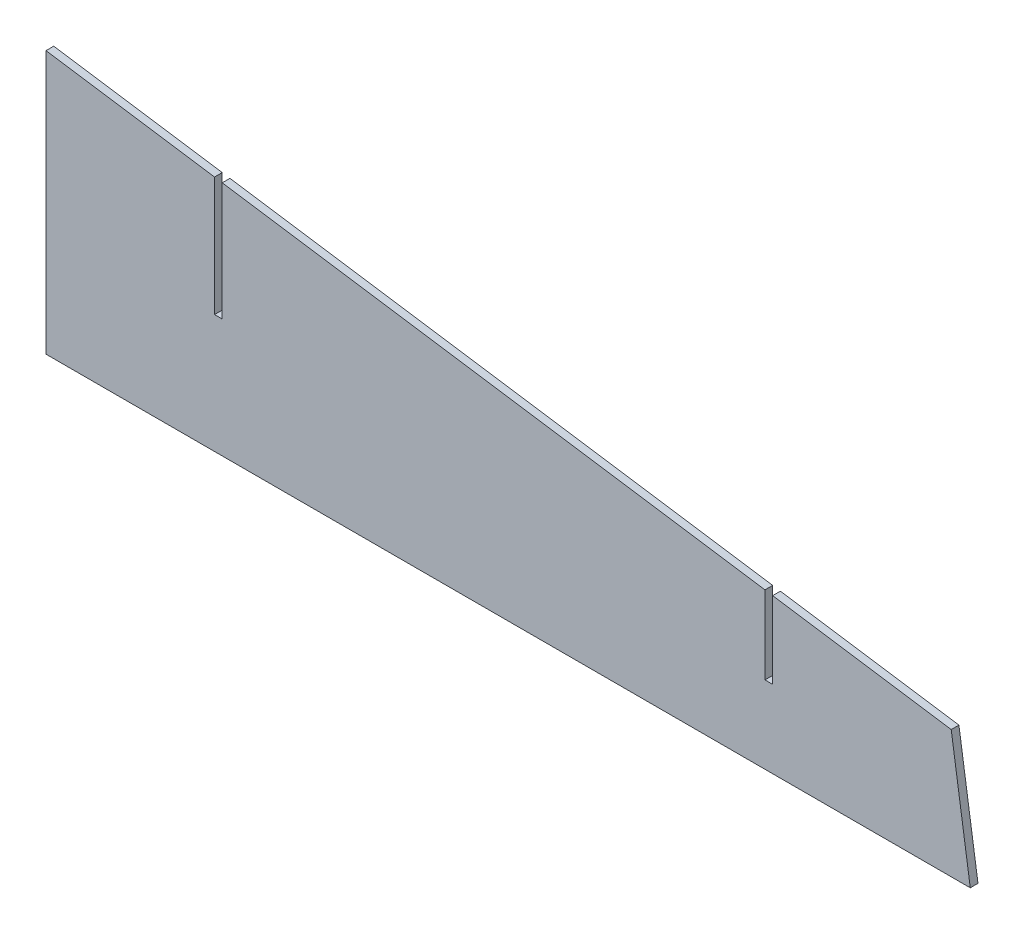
ISO-10303-21;
HEADER;
FILE_DESCRIPTION(('STEP AP214'),'2;1');
FILE_NAME('part.step','',(''),(''),'','','');
FILE_SCHEMA(('AUTOMOTIVE_DESIGN { 1 0 10303 214 1 1 1 1 }'));
ENDSEC;
DATA;
#1=APPLICATION_CONTEXT('core data for automotive mechanical design processes');
#2=APPLICATION_PROTOCOL_DEFINITION('international standard','automotive_design',2000,#1);
#3=PRODUCT_CONTEXT('',#1,'mechanical');
#4=PRODUCT('Part','Part','',(#3));
#5=PRODUCT_RELATED_PRODUCT_CATEGORY('part','',(#4));
#6=PRODUCT_DEFINITION_FORMATION('','',#4);
#7=PRODUCT_DEFINITION_CONTEXT('part definition',#1,'design');
#8=PRODUCT_DEFINITION('design','',#6,#7);
#9=PRODUCT_DEFINITION_SHAPE('','',#8);
#10=(LENGTH_UNIT() NAMED_UNIT(*) SI_UNIT(.MILLI.,.METRE.));
#11=(NAMED_UNIT(*) PLANE_ANGLE_UNIT() SI_UNIT($,.RADIAN.));
#12=(NAMED_UNIT(*) SI_UNIT($,.STERADIAN.) SOLID_ANGLE_UNIT());
#13=UNCERTAINTY_MEASURE_WITH_UNIT(LENGTH_MEASURE(1.E-05),#10,'distance_accuracy_value','');
#14=(GEOMETRIC_REPRESENTATION_CONTEXT(3) GLOBAL_UNCERTAINTY_ASSIGNED_CONTEXT((#13)) GLOBAL_UNIT_ASSIGNED_CONTEXT((#10,
#11,#12)) REPRESENTATION_CONTEXT('',''));
#15=CARTESIAN_POINT('',(0.,0.,0.));
#16=DIRECTION('',(0.,0.,1.));
#17=DIRECTION('',(1.,0.,0.));
#18=AXIS2_PLACEMENT_3D('',#15,#16,#17);
#19=CARTESIAN_POINT('',(4.36562500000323,2228.83042043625,203.596874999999));
#20=DIRECTION('',(0.,0.,-0.999999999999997));
#21=DIRECTION('',(-1.00000000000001,0.,0.));
#22=AXIS2_PLACEMENT_3D('',#19,#20,#21);
#23=PLANE('',#22);
#24=DIRECTION('',(0.147902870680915,-0.989001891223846,0.));
#25=VECTOR('',#24,1.);
#26=CARTESIAN_POINT('',(829.814263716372,2352.27429283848,203.596875));
#27=LINE('',#26,#25);
#28=CARTESIAN_POINT('',(1027.75090816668,1028.70488000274,203.596875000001));
#29=VERTEX_POINT('',#28);
#30=CARTESIAN_POINT('',(1049.31197694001,884.5296,203.596875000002));
#31=VERTEX_POINT('',#30);
#32=EDGE_CURVE('E202',#29,#31,#27,.T.);
#33=ORIENTED_EDGE('',*,*,#32,.F.);
#34=DIRECTION('',(0.989001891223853,-0.147902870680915,0.));
#35=VECTOR('',#34,1.);
#36=CARTESIAN_POINT('',(-148.7973828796,1204.65486683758,203.596874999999));
#37=LINE('',#36,#35);
#38=CARTESIAN_POINT('',(825.896875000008,1058.89166855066,203.596875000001));
#39=VERTEX_POINT('',#38);
#40=EDGE_CURVE('E44',#39,#29,#37,.T.);
#41=ORIENTED_EDGE('',*,*,#40,.F.);
#42=DIRECTION('',(0.,-1.,0.));
#43=VECTOR('',#42,1.);
#44=CARTESIAN_POINT('',(825.896875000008,972.037068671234,203.596875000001));
#45=LINE('',#44,#43);
#46=CARTESIAN_POINT('',(825.896875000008,972.037068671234,203.596875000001));
#47=VERTEX_POINT('',#46);
#48=EDGE_CURVE('E51',#39,#47,#45,.T.);
#49=ORIENTED_EDGE('',*,*,#48,.T.);
#50=DIRECTION('',(-1.00000000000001,0.,0.));
#51=VECTOR('',#50,1.);
#52=CARTESIAN_POINT('',(817.165625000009,972.037068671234,203.596875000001));
#53=LINE('',#52,#51);
#54=CARTESIAN_POINT('',(817.165625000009,972.037068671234,203.596875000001));
#55=VERTEX_POINT('',#54);
#56=EDGE_CURVE('E190',#47,#55,#53,.T.);
#57=ORIENTED_EDGE('',*,*,#56,.T.);
#58=DIRECTION('',(0.,1.,0.));
#59=VECTOR('',#58,1.);
#60=CARTESIAN_POINT('',(817.165625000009,972.037068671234,203.596875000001));
#61=LINE('',#60,#59);
#62=CARTESIAN_POINT('',(817.165625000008,1060.19740613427,203.596875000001));
#63=VERTEX_POINT('',#62);
#64=EDGE_CURVE('E198',#55,#63,#61,.T.);
#65=ORIENTED_EDGE('',*,*,#64,.T.);
#66=CARTESIAN_POINT('',(203.596875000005,1151.95514723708,203.596874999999));
#67=VERTEX_POINT('',#66);
#68=EDGE_CURVE('E42',#67,#63,#37,.T.);
#69=ORIENTED_EDGE('',*,*,#68,.F.);
#70=DIRECTION('',(0.,-1.,0.));
#71=VECTOR('',#70,1.);
#72=CARTESIAN_POINT('',(203.596875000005,1018.56880801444,203.596874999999));
#73=LINE('',#72,#71);
#74=CARTESIAN_POINT('',(203.596875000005,1018.56880801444,203.596874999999));
#75=VERTEX_POINT('',#74);
#76=EDGE_CURVE('E59',#67,#75,#73,.T.);
#77=ORIENTED_EDGE('',*,*,#76,.T.);
#78=DIRECTION('',(-1.00000000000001,0.,0.));
#79=VECTOR('',#78,1.);
#80=CARTESIAN_POINT('',(194.865625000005,1018.56880801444,203.596874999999));
#81=LINE('',#80,#79);
#82=CARTESIAN_POINT('',(194.865625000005,1018.56880801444,203.596874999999));
#83=VERTEX_POINT('',#82);
#84=EDGE_CURVE('E168',#75,#83,#81,.T.);
#85=ORIENTED_EDGE('',*,*,#84,.T.);
#86=DIRECTION('',(0.,1.,0.));
#87=VECTOR('',#86,1.);
#88=CARTESIAN_POINT('',(194.865625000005,1018.56880801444,203.596874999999));
#89=LINE('',#88,#87);
#90=CARTESIAN_POINT('',(194.865625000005,1153.26088482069,203.596874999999));
#91=VERTEX_POINT('',#90);
#92=EDGE_CURVE('E174',#83,#91,#89,.T.);
#93=ORIENTED_EDGE('',*,*,#92,.T.);
#94=CARTESIAN_POINT('',(4.3656250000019,1181.74970482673,203.596874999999));
#95=VERTEX_POINT('',#94);
#96=EDGE_CURVE('E12',#95,#91,#37,.T.);
#97=ORIENTED_EDGE('',*,*,#96,.F.);
#98=DIRECTION('',(0.,-1.,0.));
#99=VECTOR('',#98,1.);
#100=CARTESIAN_POINT('',(4.36562500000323,2228.83042043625,203.596874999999));
#101=LINE('',#100,#99);
#102=CARTESIAN_POINT('',(4.36562500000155,884.5296,203.596874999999));
#103=VERTEX_POINT('',#102);
#104=EDGE_CURVE('E219',#95,#103,#101,.T.);
#105=ORIENTED_EDGE('',*,*,#104,.T.);
#106=DIRECTION('',(1.00000000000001,0.,0.));
#107=VECTOR('',#106,1.);
#108=CARTESIAN_POINT('',(4.36562500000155,884.5296,203.596874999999));
#109=LINE('',#108,#107);
#110=EDGE_CURVE('E215',#103,#31,#109,.T.);
#111=ORIENTED_EDGE('',*,*,#110,.T.);
#112=EDGE_LOOP('',(#33,#41,#49,#57,#65,#69,#77,#85,#93,#97,#105,#111));
#113=FACE_BOUND('',#112,.T.);
#114=ADVANCED_FACE('F33',(#113),#23,.F.);
#115=CARTESIAN_POINT('',(4.36562500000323,2228.83042043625,194.865624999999));
#116=DIRECTION('',(0.,0.,0.999999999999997));
#117=DIRECTION('',(1.00000000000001,0.,0.));
#118=AXIS2_PLACEMENT_3D('',#115,#116,#117);
#119=PLANE('',#118);
#120=DIRECTION('',(-0.989001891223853,0.147902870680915,0.));
#121=VECTOR('',#120,1.);
#122=CARTESIAN_POINT('',(1141.18506681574,1011.74107250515,194.865625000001));
#123=LINE('',#122,#121);
#124=CARTESIAN_POINT('',(1027.75090816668,1028.70488000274,194.865625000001));
#125=VERTEX_POINT('',#124);
#126=CARTESIAN_POINT('',(825.896875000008,1058.89166855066,194.865625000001));
#127=VERTEX_POINT('',#126);
#128=EDGE_CURVE('E139',#125,#127,#123,.T.);
#129=ORIENTED_EDGE('',*,*,#128,.F.);
#130=DIRECTION('',(-0.147902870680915,0.989001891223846,0.));
#131=VECTOR('',#130,1.);
#132=CARTESIAN_POINT('',(1049.34054028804,884.338601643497,194.865625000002));
#133=LINE('',#132,#131);
#134=CARTESIAN_POINT('',(1049.31197694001,884.5296,194.865625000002));
#135=VERTEX_POINT('',#134);
#136=EDGE_CURVE('E126',#135,#125,#133,.T.);
#137=ORIENTED_EDGE('',*,*,#136,.F.);
#138=DIRECTION('',(-1.00000000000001,0.,0.));
#139=VECTOR('',#138,1.);
#140=CARTESIAN_POINT('',(4.36562500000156,884.5296,194.865624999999));
#141=LINE('',#140,#139);
#142=CARTESIAN_POINT('',(4.36562500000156,884.5296,194.865624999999));
#143=VERTEX_POINT('',#142);
#144=EDGE_CURVE('E217',#135,#143,#141,.T.);
#145=ORIENTED_EDGE('',*,*,#144,.T.);
#146=DIRECTION('',(0.,-1.,0.));
#147=VECTOR('',#146,1.);
#148=CARTESIAN_POINT('',(4.36562500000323,2228.83042043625,194.865624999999));
#149=LINE('',#148,#147);
#150=CARTESIAN_POINT('',(4.36562500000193,1181.74970482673,194.865624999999));
#151=VERTEX_POINT('',#150);
#152=EDGE_CURVE('E37',#151,#143,#149,.T.);
#153=ORIENTED_EDGE('',*,*,#152,.F.);
#154=CARTESIAN_POINT('',(194.865625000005,1153.26088482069,194.865624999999));
#155=VERTEX_POINT('',#154);
#156=EDGE_CURVE('E150',#155,#151,#123,.T.);
#157=ORIENTED_EDGE('',*,*,#156,.F.);
#158=DIRECTION('',(0.,1.,0.));
#159=VECTOR('',#158,1.);
#160=CARTESIAN_POINT('',(194.865625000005,1018.56880801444,194.865624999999));
#161=LINE('',#160,#159);
#162=CARTESIAN_POINT('',(194.865625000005,1018.56880801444,194.865624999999));
#163=VERTEX_POINT('',#162);
#164=EDGE_CURVE('E178',#163,#155,#161,.T.);
#165=ORIENTED_EDGE('',*,*,#164,.F.);
#166=DIRECTION('',(-1.00000000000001,0.,0.));
#167=VECTOR('',#166,1.);
#168=CARTESIAN_POINT('',(194.865625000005,1018.56880801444,194.865624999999));
#169=LINE('',#168,#167);
#170=CARTESIAN_POINT('',(203.596875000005,1018.56880801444,194.865624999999));
#171=VERTEX_POINT('',#170);
#172=EDGE_CURVE('E171',#171,#163,#169,.T.);
#173=ORIENTED_EDGE('',*,*,#172,.F.);
#174=DIRECTION('',(0.,-1.,0.));
#175=VECTOR('',#174,1.);
#176=CARTESIAN_POINT('',(203.596875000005,1018.56880801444,194.865624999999));
#177=LINE('',#176,#175);
#178=CARTESIAN_POINT('',(203.596875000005,1151.95514723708,194.865624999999));
#179=VERTEX_POINT('',#178);
#180=EDGE_CURVE('E175',#179,#171,#177,.T.);
#181=ORIENTED_EDGE('',*,*,#180,.F.);
#182=CARTESIAN_POINT('',(817.165625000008,1060.19740613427,194.865625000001));
#183=VERTEX_POINT('',#182);
#184=EDGE_CURVE('E148',#183,#179,#123,.T.);
#185=ORIENTED_EDGE('',*,*,#184,.F.);
#186=DIRECTION('',(0.,1.,0.));
#187=VECTOR('',#186,1.);
#188=CARTESIAN_POINT('',(817.165625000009,972.037068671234,194.865625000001));
#189=LINE('',#188,#187);
#190=CARTESIAN_POINT('',(817.165625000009,972.037068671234,194.865625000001));
#191=VERTEX_POINT('',#190);
#192=EDGE_CURVE('E200',#191,#183,#189,.T.);
#193=ORIENTED_EDGE('',*,*,#192,.F.);
#194=DIRECTION('',(-1.00000000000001,0.,0.));
#195=VECTOR('',#194,1.);
#196=CARTESIAN_POINT('',(817.165625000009,972.037068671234,194.865625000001));
#197=LINE('',#196,#195);
#198=CARTESIAN_POINT('',(825.896875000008,972.037068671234,194.865625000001));
#199=VERTEX_POINT('',#198);
#200=EDGE_CURVE('E195',#199,#191,#197,.T.);
#201=ORIENTED_EDGE('',*,*,#200,.F.);
#202=DIRECTION('',(0.,-1.,0.));
#203=VECTOR('',#202,1.);
#204=CARTESIAN_POINT('',(825.896875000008,972.037068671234,194.865625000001));
#205=LINE('',#204,#203);
#206=EDGE_CURVE('E147',#127,#199,#205,.T.);
#207=ORIENTED_EDGE('',*,*,#206,.F.);
#208=EDGE_LOOP('',(#129,#137,#145,#153,#157,#165,#173,#181,#185,#193,#201,#207));
#209=FACE_BOUND('',#208,.T.);
#210=ADVANCED_FACE('F144',(#209),#119,.F.);
#211=CARTESIAN_POINT('',(1.10319555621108E-12,884.5296,0.));
#212=DIRECTION('',(0.,-1.,0.));
#213=DIRECTION('',(0.,0.,-0.999999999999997));
#214=AXIS2_PLACEMENT_3D('',#211,#212,#213);
#215=PLANE('',#214);
#216=DIRECTION('',(0.,0.,-0.999999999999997));
#217=VECTOR('',#216,1.);
#218=CARTESIAN_POINT('',(1049.31197694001,884.5296,1.66533453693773E-12));
#219=LINE('',#218,#217);
#220=EDGE_CURVE('E132',#31,#135,#219,.T.);
#221=ORIENTED_EDGE('',*,*,#220,.F.);
#222=ORIENTED_EDGE('',*,*,#110,.F.);
#223=DIRECTION('',(0.,0.,0.999999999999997));
#224=VECTOR('',#223,1.);
#225=CARTESIAN_POINT('',(4.36562500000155,884.5296,203.596874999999));
#226=LINE('',#225,#224);
#227=EDGE_CURVE('E152',#143,#103,#226,.T.);
#228=ORIENTED_EDGE('',*,*,#227,.F.);
#229=ORIENTED_EDGE('',*,*,#144,.F.);
#230=EDGE_LOOP('',(#221,#222,#228,#229));
#231=FACE_BOUND('',#230,.T.);
#232=ADVANCED_FACE('F213',(#231),#215,.T.);
#233=CARTESIAN_POINT('',(1141.18506681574,1011.74107250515,203.596875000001));
#234=DIRECTION('',(-0.147902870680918,-0.989001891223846,0.));
#235=DIRECTION('',(0.989001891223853,-0.147902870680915,0.));
#236=AXIS2_PLACEMENT_3D('',#233,#234,#235);
#237=PLANE('',#236);
#238=ORIENTED_EDGE('',*,*,#40,.T.);
#239=DIRECTION('',(0.,0.,0.999999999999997));
#240=VECTOR('',#239,1.);
#241=CARTESIAN_POINT('',(1027.75090816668,1028.70488000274,194.865625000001));
#242=LINE('',#241,#240);
#243=EDGE_CURVE('E129',#125,#29,#242,.T.);
#244=ORIENTED_EDGE('',*,*,#243,.F.);
#245=ORIENTED_EDGE('',*,*,#128,.T.);
#246=DIRECTION('',(0.,0.,-0.999999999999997));
#247=VECTOR('',#246,1.);
#248=CARTESIAN_POINT('',(825.896875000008,1058.89166855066,203.596875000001));
#249=LINE('',#248,#247);
#250=EDGE_CURVE('E189',#39,#127,#249,.T.);
#251=ORIENTED_EDGE('',*,*,#250,.F.);
#252=EDGE_LOOP('',(#238,#244,#245,#251));
#253=FACE_BOUND('',#252,.T.);
#254=ADVANCED_FACE('F138',(#253),#237,.F.);
#255=ORIENTED_EDGE('',*,*,#68,.T.);
#256=DIRECTION('',(0.,0.,-0.999999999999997));
#257=VECTOR('',#256,1.);
#258=CARTESIAN_POINT('',(817.165625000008,1060.19740613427,203.596875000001));
#259=LINE('',#258,#257);
#260=EDGE_CURVE('E186',#63,#183,#259,.T.);
#261=ORIENTED_EDGE('',*,*,#260,.T.);
#262=ORIENTED_EDGE('',*,*,#184,.T.);
#263=DIRECTION('',(0.,0.,-0.999999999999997));
#264=VECTOR('',#263,1.);
#265=CARTESIAN_POINT('',(203.596875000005,1151.95514723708,203.596874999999));
#266=LINE('',#265,#264);
#267=EDGE_CURVE('E167',#67,#179,#266,.T.);
#268=ORIENTED_EDGE('',*,*,#267,.F.);
#269=EDGE_LOOP('',(#255,#261,#262,#268));
#270=FACE_BOUND('',#269,.T.);
#271=ADVANCED_FACE('F240',(#270),#237,.F.);
#272=ORIENTED_EDGE('',*,*,#96,.T.);
#273=DIRECTION('',(0.,0.,-0.999999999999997));
#274=VECTOR('',#273,1.);
#275=CARTESIAN_POINT('',(194.865625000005,1153.26088482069,203.596874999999));
#276=LINE('',#275,#274);
#277=EDGE_CURVE('E165',#91,#155,#276,.T.);
#278=ORIENTED_EDGE('',*,*,#277,.T.);
#279=ORIENTED_EDGE('',*,*,#156,.T.);
#280=DIRECTION('',(0.,0.,0.999999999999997));
#281=VECTOR('',#280,1.);
#282=CARTESIAN_POINT('',(4.36562500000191,1181.74970482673,203.596874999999));
#283=LINE('',#282,#281);
#284=EDGE_CURVE('E155',#151,#95,#283,.T.);
#285=ORIENTED_EDGE('',*,*,#284,.T.);
#286=EDGE_LOOP('',(#272,#278,#279,#285));
#287=FACE_BOUND('',#286,.T.);
#288=ADVANCED_FACE('F230',(#287),#237,.F.);
#289=CARTESIAN_POINT('',(4.36562500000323,2228.83042043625,203.596874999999));
#290=DIRECTION('',(1.00000000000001,0.,0.));
#291=DIRECTION('',(0.,0.,-0.999999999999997));
#292=AXIS2_PLACEMENT_3D('',#289,#290,#291);
#293=PLANE('',#292);
#294=ORIENTED_EDGE('',*,*,#104,.F.);
#295=ORIENTED_EDGE('',*,*,#284,.F.);
#296=ORIENTED_EDGE('',*,*,#152,.T.);
#297=ORIENTED_EDGE('',*,*,#227,.T.);
#298=EDGE_LOOP('',(#294,#295,#296,#297));
#299=FACE_BOUND('',#298,.T.);
#300=ADVANCED_FACE('F35',(#299),#293,.F.);
#301=CARTESIAN_POINT('',(194.865625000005,1018.56880801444,203.596874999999));
#302=DIRECTION('',(-1.00000000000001,0.,0.));
#303=DIRECTION('',(0.,-1.,0.));
#304=AXIS2_PLACEMENT_3D('',#301,#302,#303);
#305=PLANE('',#304);
#306=ORIENTED_EDGE('',*,*,#164,.T.);
#307=ORIENTED_EDGE('',*,*,#277,.F.);
#308=ORIENTED_EDGE('',*,*,#92,.F.);
#309=DIRECTION('',(0.,0.,-0.999999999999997));
#310=VECTOR('',#309,1.);
#311=CARTESIAN_POINT('',(194.865625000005,1018.56880801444,203.596874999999));
#312=LINE('',#311,#310);
#313=EDGE_CURVE('E160',#83,#163,#312,.T.);
#314=ORIENTED_EDGE('',*,*,#313,.T.);
#315=EDGE_LOOP('',(#306,#307,#308,#314));
#316=FACE_BOUND('',#315,.T.);
#317=ADVANCED_FACE('F228',(#316),#305,.F.);
#318=CARTESIAN_POINT('',(194.865625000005,1018.56880801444,203.596874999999));
#319=DIRECTION('',(0.,-1.,0.));
#320=DIRECTION('',(0.,0.,-0.999999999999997));
#321=AXIS2_PLACEMENT_3D('',#318,#319,#320);
#322=PLANE('',#321);
#323=ORIENTED_EDGE('',*,*,#172,.T.);
#324=ORIENTED_EDGE('',*,*,#313,.F.);
#325=ORIENTED_EDGE('',*,*,#84,.F.);
#326=DIRECTION('',(0.,0.,-0.999999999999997));
#327=VECTOR('',#326,1.);
#328=CARTESIAN_POINT('',(203.596875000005,1018.56880801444,203.596874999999));
#329=LINE('',#328,#327);
#330=EDGE_CURVE('E162',#75,#171,#329,.T.);
#331=ORIENTED_EDGE('',*,*,#330,.T.);
#332=EDGE_LOOP('',(#323,#324,#325,#331));
#333=FACE_BOUND('',#332,.T.);
#334=ADVANCED_FACE('F234',(#333),#322,.F.);
#335=CARTESIAN_POINT('',(203.596875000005,1018.56880801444,203.596874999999));
#336=DIRECTION('',(1.00000000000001,0.,0.));
#337=DIRECTION('',(0.,0.,-0.999999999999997));
#338=AXIS2_PLACEMENT_3D('',#335,#336,#337);
#339=PLANE('',#338);
#340=ORIENTED_EDGE('',*,*,#180,.T.);
#341=ORIENTED_EDGE('',*,*,#330,.F.);
#342=ORIENTED_EDGE('',*,*,#76,.F.);
#343=ORIENTED_EDGE('',*,*,#267,.T.);
#344=EDGE_LOOP('',(#340,#341,#342,#343));
#345=FACE_BOUND('',#344,.T.);
#346=ADVANCED_FACE('F235',(#345),#339,.F.);
#347=CARTESIAN_POINT('',(817.165625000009,972.037068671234,203.596875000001));
#348=DIRECTION('',(-1.00000000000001,0.,0.));
#349=DIRECTION('',(0.,-1.,0.));
#350=AXIS2_PLACEMENT_3D('',#347,#348,#349);
#351=PLANE('',#350);
#352=ORIENTED_EDGE('',*,*,#192,.T.);
#353=ORIENTED_EDGE('',*,*,#260,.F.);
#354=ORIENTED_EDGE('',*,*,#64,.F.);
#355=DIRECTION('',(0.,0.,-0.999999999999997));
#356=VECTOR('',#355,1.);
#357=CARTESIAN_POINT('',(817.165625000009,972.037068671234,203.596875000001));
#358=LINE('',#357,#356);
#359=EDGE_CURVE('E180',#55,#191,#358,.T.);
#360=ORIENTED_EDGE('',*,*,#359,.T.);
#361=EDGE_LOOP('',(#352,#353,#354,#360));
#362=FACE_BOUND('',#361,.T.);
#363=ADVANCED_FACE('F243',(#362),#351,.F.);
#364=CARTESIAN_POINT('',(817.165625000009,972.037068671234,203.596875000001));
#365=DIRECTION('',(0.,-1.,0.));
#366=DIRECTION('',(0.,0.,-0.999999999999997));
#367=AXIS2_PLACEMENT_3D('',#364,#365,#366);
#368=PLANE('',#367);
#369=ORIENTED_EDGE('',*,*,#200,.T.);
#370=ORIENTED_EDGE('',*,*,#359,.F.);
#371=ORIENTED_EDGE('',*,*,#56,.F.);
#372=DIRECTION('',(0.,0.,-0.999999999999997));
#373=VECTOR('',#372,1.);
#374=CARTESIAN_POINT('',(825.896875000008,972.037068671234,203.596875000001));
#375=LINE('',#374,#373);
#376=EDGE_CURVE('E192',#47,#199,#375,.T.);
#377=ORIENTED_EDGE('',*,*,#376,.T.);
#378=EDGE_LOOP('',(#369,#370,#371,#377));
#379=FACE_BOUND('',#378,.T.);
#380=ADVANCED_FACE('F246',(#379),#368,.F.);
#381=CARTESIAN_POINT('',(825.896875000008,972.037068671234,203.596875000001));
#382=DIRECTION('',(1.00000000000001,0.,0.));
#383=DIRECTION('',(0.,0.,-0.999999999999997));
#384=AXIS2_PLACEMENT_3D('',#381,#382,#383);
#385=PLANE('',#384);
#386=ORIENTED_EDGE('',*,*,#206,.T.);
#387=ORIENTED_EDGE('',*,*,#376,.F.);
#388=ORIENTED_EDGE('',*,*,#48,.F.);
#389=ORIENTED_EDGE('',*,*,#250,.T.);
#390=EDGE_LOOP('',(#386,#387,#388,#389));
#391=FACE_BOUND('',#390,.T.);
#392=ADVANCED_FACE('F247',(#391),#385,.F.);
#393=CARTESIAN_POINT('',(1049.34054028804,884.338601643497,194.865625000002));
#394=DIRECTION('',(-0.989001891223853,-0.147902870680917,0.));
#395=DIRECTION('',(0.147902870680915,-0.989001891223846,0.));
#396=AXIS2_PLACEMENT_3D('',#393,#394,#395);
#397=PLANE('',#396);
#398=ORIENTED_EDGE('',*,*,#220,.T.);
#399=ORIENTED_EDGE('',*,*,#136,.T.);
#400=ORIENTED_EDGE('',*,*,#243,.T.);
#401=ORIENTED_EDGE('',*,*,#32,.T.);
#402=EDGE_LOOP('',(#398,#399,#400,#401));
#403=FACE_BOUND('',#402,.T.);
#404=ADVANCED_FACE('F128',(#403),#397,.F.);
#405=CLOSED_SHELL('',(#114,#210,#232,#254,#271,#288,#300,#317,#334,#346,#363,#380,#392,#404));
#406=MANIFOLD_SOLID_BREP('B2',#405);
#407=ADVANCED_BREP_SHAPE_REPRESENTATION('',(#18,#406),#14);
#408=SHAPE_DEFINITION_REPRESENTATION(#9,#407);
ENDSEC;
END-ISO-10303-21;
